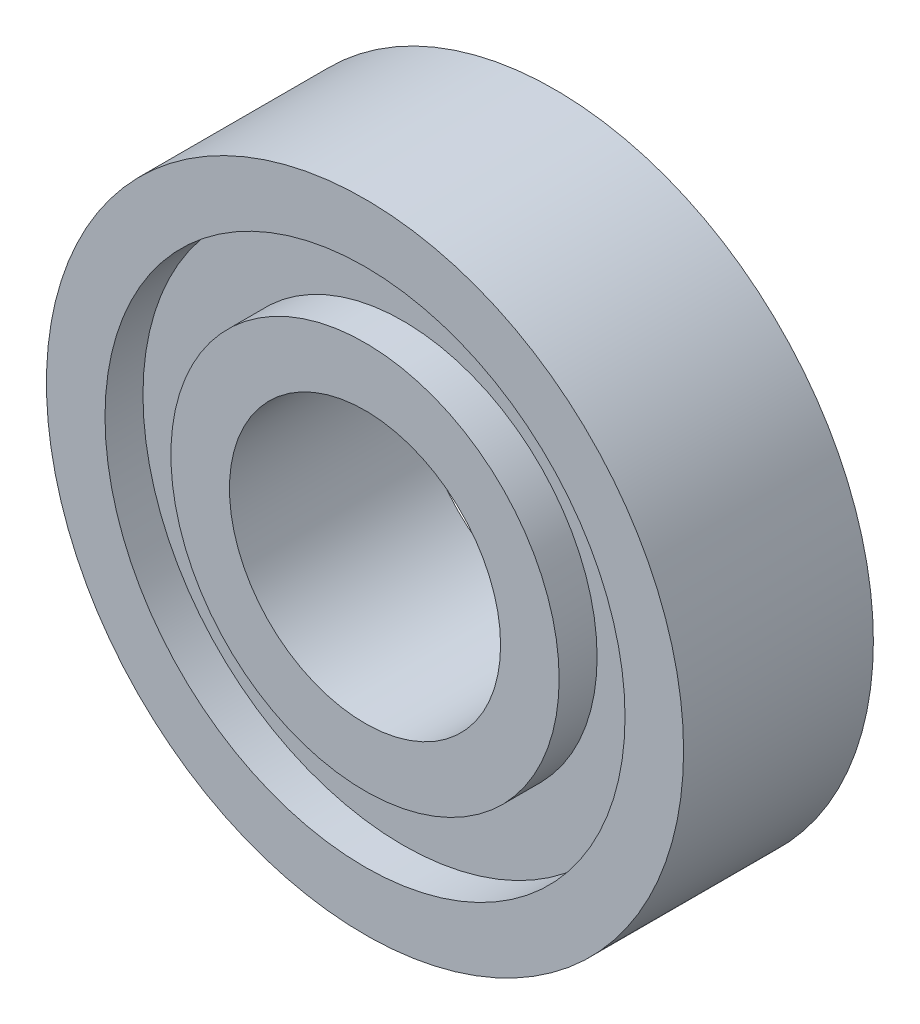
ISO-10303-21;
HEADER;
FILE_DESCRIPTION(('STEP AP214'),'2;1');
FILE_NAME('part.step','',(''),(''),'','','');
FILE_SCHEMA(('AUTOMOTIVE_DESIGN { 1 0 10303 214 1 1 1 1 }'));
ENDSEC;
DATA;
#1=APPLICATION_CONTEXT('core data for automotive mechanical design processes');
#2=APPLICATION_PROTOCOL_DEFINITION('international standard','automotive_design',2000,#1);
#3=PRODUCT_CONTEXT('',#1,'mechanical');
#4=PRODUCT('Part','Part','',(#3));
#5=PRODUCT_RELATED_PRODUCT_CATEGORY('part','',(#4));
#6=PRODUCT_DEFINITION_FORMATION('','',#4);
#7=PRODUCT_DEFINITION_CONTEXT('part definition',#1,'design');
#8=PRODUCT_DEFINITION('design','',#6,#7);
#9=PRODUCT_DEFINITION_SHAPE('','',#8);
#10=(LENGTH_UNIT() NAMED_UNIT(*) SI_UNIT(.MILLI.,.METRE.));
#11=(NAMED_UNIT(*) PLANE_ANGLE_UNIT() SI_UNIT($,.RADIAN.));
#12=(NAMED_UNIT(*) SI_UNIT($,.STERADIAN.) SOLID_ANGLE_UNIT());
#13=UNCERTAINTY_MEASURE_WITH_UNIT(LENGTH_MEASURE(1.E-05),#10,'distance_accuracy_value','');
#14=(GEOMETRIC_REPRESENTATION_CONTEXT(3) GLOBAL_UNCERTAINTY_ASSIGNED_CONTEXT((#13)) GLOBAL_UNIT_ASSIGNED_CONTEXT((#10,
#11,#12)) REPRESENTATION_CONTEXT('',''));
#15=CARTESIAN_POINT('',(0.,0.,0.));
#16=DIRECTION('',(0.,0.,1.));
#17=DIRECTION('',(1.,0.,0.));
#18=AXIS2_PLACEMENT_3D('',#15,#16,#17);
#19=CARTESIAN_POINT('',(0.,0.,7.));
#20=DIRECTION('',(0.,0.,-1.));
#21=DIRECTION('',(-1.,0.,0.));
#22=AXIS2_PLACEMENT_3D('',#19,#20,#21);
#23=CYLINDRICAL_SURFACE('',#22,19.18);
#24=CARTESIAN_POINT('',(0.,0.,-7.));
#25=DIRECTION('',(0.,0.,1.));
#26=DIRECTION('',(1.,0.,0.));
#27=AXIS2_PLACEMENT_3D('',#24,#25,#26);
#28=CIRCLE('',#27,19.18);
#29=CARTESIAN_POINT('',(19.18,0.,-7.));
#30=VERTEX_POINT('',#29);
#31=EDGE_CURVE('E59',#30,#30,#28,.T.);
#32=ORIENTED_EDGE('',*,*,#31,.F.);
#33=EDGE_LOOP('',(#32));
#34=FACE_BOUND('',#33,.T.);
#35=CARTESIAN_POINT('',(0.,0.,-4.2));
#36=DIRECTION('',(0.,0.,1.));
#37=DIRECTION('',(1.,0.,0.));
#38=AXIS2_PLACEMENT_3D('',#35,#36,#37);
#39=CIRCLE('',#38,19.18);
#40=CARTESIAN_POINT('',(19.18,0.,-4.2));
#41=VERTEX_POINT('',#40);
#42=EDGE_CURVE('E62',#41,#41,#39,.T.);
#43=ORIENTED_EDGE('',*,*,#42,.T.);
#44=EDGE_LOOP('',(#43));
#45=FACE_BOUND('',#44,.T.);
#46=ADVANCED_FACE('F41',(#34,#45),#23,.F.);
#47=CARTESIAN_POINT('',(0.,0.,7.));
#48=DIRECTION('',(0.,0.,1.));
#49=DIRECTION('',(1.,0.,0.));
#50=AXIS2_PLACEMENT_3D('',#47,#48,#49);
#51=PLANE('',#50);
#52=CARTESIAN_POINT('',(0.,0.,7.));
#53=DIRECTION('',(0.,0.,1.));
#54=DIRECTION('',(1.,0.,0.));
#55=AXIS2_PLACEMENT_3D('',#52,#53,#54);
#56=CIRCLE('',#55,23.5);
#57=CARTESIAN_POINT('',(23.5,0.,7.));
#58=VERTEX_POINT('',#57);
#59=EDGE_CURVE('E48',#58,#58,#56,.T.);
#60=ORIENTED_EDGE('',*,*,#59,.T.);
#61=EDGE_LOOP('',(#60));
#62=FACE_BOUND('',#61,.T.);
#63=CARTESIAN_POINT('',(0.,0.,7.));
#64=DIRECTION('',(0.,0.,1.));
#65=DIRECTION('',(1.,0.,0.));
#66=AXIS2_PLACEMENT_3D('',#63,#64,#65);
#67=CIRCLE('',#66,19.18);
#68=CARTESIAN_POINT('',(19.18,0.,7.));
#69=VERTEX_POINT('',#68);
#70=EDGE_CURVE('E57',#69,#69,#67,.T.);
#71=ORIENTED_EDGE('',*,*,#70,.F.);
#72=EDGE_LOOP('',(#71));
#73=FACE_BOUND('',#72,.T.);
#74=ADVANCED_FACE('F107',(#62,#73),#51,.T.);
#75=CARTESIAN_POINT('',(0.,0.,-7.));
#76=DIRECTION('',(0.,0.,1.));
#77=DIRECTION('',(1.,0.,0.));
#78=AXIS2_PLACEMENT_3D('',#75,#76,#77);
#79=PLANE('',#78);
#80=CARTESIAN_POINT('',(0.,0.,-7.));
#81=DIRECTION('',(0.,0.,1.));
#82=DIRECTION('',(1.,0.,0.));
#83=AXIS2_PLACEMENT_3D('',#80,#81,#82);
#84=CIRCLE('',#83,23.5);
#85=CARTESIAN_POINT('',(23.5,0.,-7.));
#86=VERTEX_POINT('',#85);
#87=EDGE_CURVE('E52',#86,#86,#84,.T.);
#88=ORIENTED_EDGE('',*,*,#87,.F.);
#89=EDGE_LOOP('',(#88));
#90=FACE_BOUND('',#89,.T.);
#91=ORIENTED_EDGE('',*,*,#31,.T.);
#92=EDGE_LOOP('',(#91));
#93=FACE_BOUND('',#92,.T.);
#94=ADVANCED_FACE('F116',(#90,#93),#79,.F.);
#95=CARTESIAN_POINT('',(0.,0.,7.));
#96=DIRECTION('',(0.,0.,-1.));
#97=DIRECTION('',(-1.,0.,0.));
#98=AXIS2_PLACEMENT_3D('',#95,#96,#97);
#99=CYLINDRICAL_SURFACE('',#98,23.5);
#100=ORIENTED_EDGE('',*,*,#59,.F.);
#101=EDGE_LOOP('',(#100));
#102=FACE_BOUND('',#101,.T.);
#103=ORIENTED_EDGE('',*,*,#87,.T.);
#104=EDGE_LOOP('',(#103));
#105=FACE_BOUND('',#104,.T.);
#106=ADVANCED_FACE('F43',(#102,#105),#99,.T.);
#107=CARTESIAN_POINT('',(0.,0.,4.2));
#108=DIRECTION('',(0.,0.,1.));
#109=DIRECTION('',(1.,0.,0.));
#110=AXIS2_PLACEMENT_3D('',#107,#108,#109);
#111=CIRCLE('',#110,19.18);
#112=CARTESIAN_POINT('',(19.18,0.,4.2));
#113=VERTEX_POINT('',#112);
#114=EDGE_CURVE('E10',#113,#113,#111,.T.);
#115=ORIENTED_EDGE('',*,*,#114,.F.);
#116=EDGE_LOOP('',(#115));
#117=FACE_BOUND('',#116,.T.);
#118=ORIENTED_EDGE('',*,*,#70,.T.);
#119=EDGE_LOOP('',(#118));
#120=FACE_BOUND('',#119,.T.);
#121=ADVANCED_FACE('F110',(#117,#120),#23,.F.);
#122=CARTESIAN_POINT('',(0.,0.,4.2));
#123=DIRECTION('',(0.,0.,1.));
#124=DIRECTION('',(1.,0.,0.));
#125=AXIS2_PLACEMENT_3D('',#122,#123,#124);
#126=PLANE('',#125);
#127=ORIENTED_EDGE('',*,*,#114,.T.);
#128=EDGE_LOOP('',(#127));
#129=FACE_BOUND('',#128,.T.);
#130=CARTESIAN_POINT('',(0.,0.,4.2));
#131=DIRECTION('',(0.,0.,1.));
#132=DIRECTION('',(1.,0.,0.));
#133=AXIS2_PLACEMENT_3D('',#130,#131,#132);
#134=CIRCLE('',#133,14.32);
#135=CARTESIAN_POINT('',(14.32,0.,4.2));
#136=VERTEX_POINT('',#135);
#137=EDGE_CURVE('E67',#136,#136,#134,.T.);
#138=ORIENTED_EDGE('',*,*,#137,.F.);
#139=EDGE_LOOP('',(#138));
#140=FACE_BOUND('',#139,.T.);
#141=ADVANCED_FACE('F121',(#129,#140),#126,.T.);
#142=CARTESIAN_POINT('',(0.,0.,-4.2));
#143=DIRECTION('',(0.,0.,1.));
#144=DIRECTION('',(1.,0.,0.));
#145=AXIS2_PLACEMENT_3D('',#142,#143,#144);
#146=PLANE('',#145);
#147=ORIENTED_EDGE('',*,*,#42,.F.);
#148=EDGE_LOOP('',(#147));
#149=FACE_BOUND('',#148,.T.);
#150=CARTESIAN_POINT('',(0.,0.,-4.2));
#151=DIRECTION('',(0.,0.,1.));
#152=DIRECTION('',(1.,0.,0.));
#153=AXIS2_PLACEMENT_3D('',#150,#151,#152);
#154=CIRCLE('',#153,14.32);
#155=CARTESIAN_POINT('',(14.32,0.,-4.2));
#156=VERTEX_POINT('',#155);
#157=EDGE_CURVE('E70',#156,#156,#154,.F.);
#158=ORIENTED_EDGE('',*,*,#157,.F.);
#159=EDGE_LOOP('',(#158));
#160=FACE_BOUND('',#159,.T.);
#161=ADVANCED_FACE('F102',(#149,#160),#146,.F.);
#162=CARTESIAN_POINT('',(0.,0.,7.));
#163=DIRECTION('',(0.,0.,-1.));
#164=DIRECTION('',(-1.,0.,0.));
#165=AXIS2_PLACEMENT_3D('',#162,#163,#164);
#166=CYLINDRICAL_SURFACE('',#165,14.32);
#167=CARTESIAN_POINT('',(0.,0.,-7.));
#168=DIRECTION('',(0.,0.,1.));
#169=DIRECTION('',(1.,0.,0.));
#170=AXIS2_PLACEMENT_3D('',#167,#168,#169);
#171=CIRCLE('',#170,14.32);
#172=CARTESIAN_POINT('',(14.32,0.,-7.));
#173=VERTEX_POINT('',#172);
#174=EDGE_CURVE('E74',#173,#173,#171,.T.);
#175=ORIENTED_EDGE('',*,*,#174,.T.);
#176=EDGE_LOOP('',(#175));
#177=FACE_BOUND('',#176,.T.);
#178=ORIENTED_EDGE('',*,*,#157,.T.);
#179=EDGE_LOOP('',(#178));
#180=FACE_BOUND('',#179,.T.);
#181=ADVANCED_FACE('F92',(#177,#180),#166,.T.);
#182=CARTESIAN_POINT('',(0.,0.,7.));
#183=DIRECTION('',(0.,0.,1.));
#184=DIRECTION('',(1.,0.,0.));
#185=AXIS2_PLACEMENT_3D('',#182,#183,#184);
#186=PLANE('',#185);
#187=CARTESIAN_POINT('',(0.,0.,7.));
#188=DIRECTION('',(0.,0.,1.));
#189=DIRECTION('',(1.,0.,0.));
#190=AXIS2_PLACEMENT_3D('',#187,#188,#189);
#191=CIRCLE('',#190,14.32);
#192=CARTESIAN_POINT('',(14.32,0.,7.));
#193=VERTEX_POINT('',#192);
#194=EDGE_CURVE('E73',#193,#193,#191,.T.);
#195=ORIENTED_EDGE('',*,*,#194,.T.);
#196=EDGE_LOOP('',(#195));
#197=FACE_BOUND('',#196,.T.);
#198=CARTESIAN_POINT('',(0.,0.,7.));
#199=DIRECTION('',(0.,0.,1.));
#200=DIRECTION('',(1.,0.,0.));
#201=AXIS2_PLACEMENT_3D('',#198,#199,#200);
#202=CIRCLE('',#201,10.);
#203=CARTESIAN_POINT('',(10.,0.,7.));
#204=VERTEX_POINT('',#203);
#205=EDGE_CURVE('E77',#204,#204,#202,.T.);
#206=ORIENTED_EDGE('',*,*,#205,.F.);
#207=EDGE_LOOP('',(#206));
#208=FACE_BOUND('',#207,.T.);
#209=ADVANCED_FACE('F89',(#197,#208),#186,.T.);
#210=CARTESIAN_POINT('',(0.,0.,-7.));
#211=DIRECTION('',(0.,0.,1.));
#212=DIRECTION('',(1.,0.,0.));
#213=AXIS2_PLACEMENT_3D('',#210,#211,#212);
#214=PLANE('',#213);
#215=ORIENTED_EDGE('',*,*,#174,.F.);
#216=EDGE_LOOP('',(#215));
#217=FACE_BOUND('',#216,.T.);
#218=CARTESIAN_POINT('',(0.,0.,-7.));
#219=DIRECTION('',(0.,0.,1.));
#220=DIRECTION('',(1.,0.,0.));
#221=AXIS2_PLACEMENT_3D('',#218,#219,#220);
#222=CIRCLE('',#221,10.);
#223=CARTESIAN_POINT('',(10.,0.,-7.));
#224=VERTEX_POINT('',#223);
#225=EDGE_CURVE('E80',#224,#224,#222,.T.);
#226=ORIENTED_EDGE('',*,*,#225,.T.);
#227=EDGE_LOOP('',(#226));
#228=FACE_BOUND('',#227,.T.);
#229=ADVANCED_FACE('F91',(#217,#228),#214,.F.);
#230=ORIENTED_EDGE('',*,*,#137,.T.);
#231=EDGE_LOOP('',(#230));
#232=FACE_BOUND('',#231,.T.);
#233=ORIENTED_EDGE('',*,*,#194,.F.);
#234=EDGE_LOOP('',(#233));
#235=FACE_BOUND('',#234,.T.);
#236=ADVANCED_FACE('F99',(#232,#235),#166,.T.);
#237=CARTESIAN_POINT('',(0.,0.,7.));
#238=DIRECTION('',(0.,0.,-1.));
#239=DIRECTION('',(-1.,0.,0.));
#240=AXIS2_PLACEMENT_3D('',#237,#238,#239);
#241=CYLINDRICAL_SURFACE('',#240,10.);
#242=ORIENTED_EDGE('',*,*,#205,.T.);
#243=EDGE_LOOP('',(#242));
#244=FACE_BOUND('',#243,.T.);
#245=ORIENTED_EDGE('',*,*,#225,.F.);
#246=EDGE_LOOP('',(#245));
#247=FACE_BOUND('',#246,.T.);
#248=ADVANCED_FACE('F86',(#244,#247),#241,.F.);
#249=CLOSED_SHELL('',(#46,#74,#94,#106,#121,#141,#161,#181,#209,#229,#236,#248));
#250=MANIFOLD_SOLID_BREP('B2',#249);
#251=ADVANCED_BREP_SHAPE_REPRESENTATION('',(#18,#250),#14);
#252=SHAPE_DEFINITION_REPRESENTATION(#9,#251);
ENDSEC;
END-ISO-10303-21;
